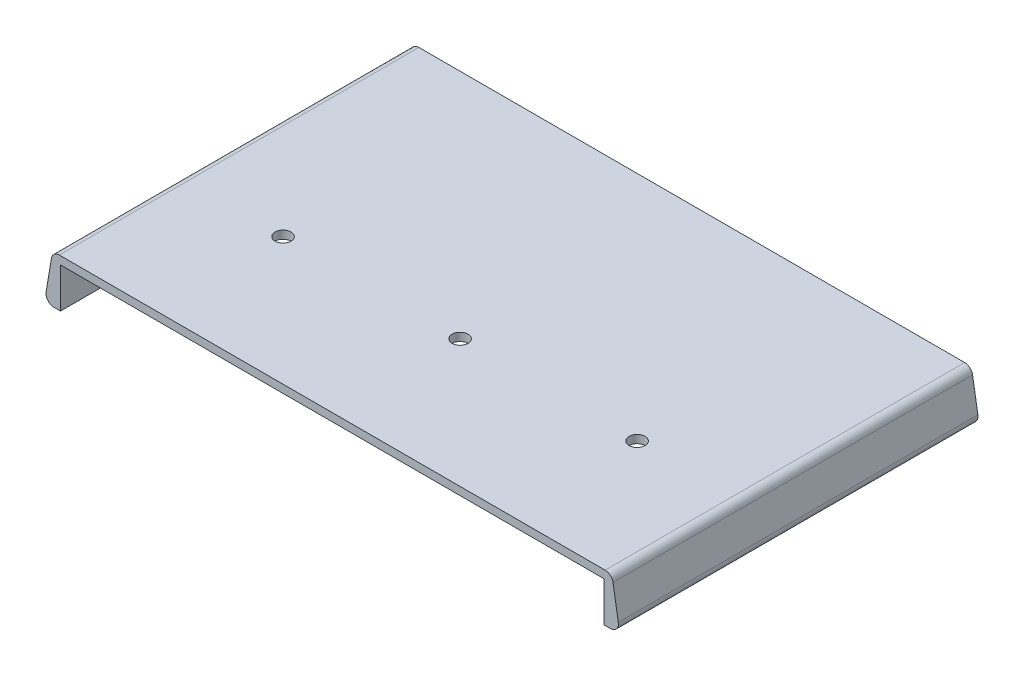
from build123d import *

# Parameters (mm, degrees)
EXTRUDE1_DEPTH    = 285.75
SKETCH6_R         = 6.35
EXTRUDE2_DEPTH    = 368.205704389
CRVPATTERN1_COUNT = 3
CRVPATTERN1_PITCH = 140.670742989


with BuildPart() as part:
    # Sketch1 → Extrude1 (new body)
    with BuildSketch(Plane.XY):
        with BuildLine():
            Line((-215.9, 0), (215.9, 0))
            Line((215.9, 0), (215.9, -31.75))
            Line((215.9, -31.75), (221.104076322, -31.75))
            ThreePointArc((221.104076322, -31.75), (225.949253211, -29.50448059), (227.367677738, -24.356066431))
            Line((227.367677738, -24.356066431), (223.134344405, 1.043933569))
            ThreePointArc((223.134344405, 1.043933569), (220.975223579, 4.845176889), (216.870742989, 6.35))
            Line((216.870742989, 6.35), (-216.870742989, 6.35))
            ThreePointArc((-216.870742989, 6.35), (-220.975223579, 4.845176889), (-223.134344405, 1.043933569))
            Line((-223.134344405, 1.043933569), (-227.367677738, -24.356066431))
            ThreePointArc((-227.367677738, -24.356066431), (-225.949253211, -29.50448059), (-221.104076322, -31.75))
            Line((-221.104076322, -31.75), (-215.9, -31.75))
            Line((-215.9, -31.75), (-215.9, 0))
        make_face()
    extrude(amount=EXTRUDE1_DEPTH)

    # Sketch6 → Extrude2 (cut, through all)
    with BuildSketch(Plane(origin=(0, 6.35, 0), x_dir=(1, 0, 0), z_dir=(0, 1, 0))):
        with Locations(Location((-140.670742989, -184.15, 0), (0, 0, 270))):
            Circle(SKETCH6_R)
    extrude2 = extrude(amount=-EXTRUDE2_DEPTH, mode=Mode.SUBTRACT)

    # CrvPattern1: Extrude2 ×3
    with Locations(*[(i * CRVPATTERN1_PITCH, 0, 0) for i in range(1, CRVPATTERN1_COUNT)]):
        add(extrude2, mode=Mode.SUBTRACT)


solid = part.part
